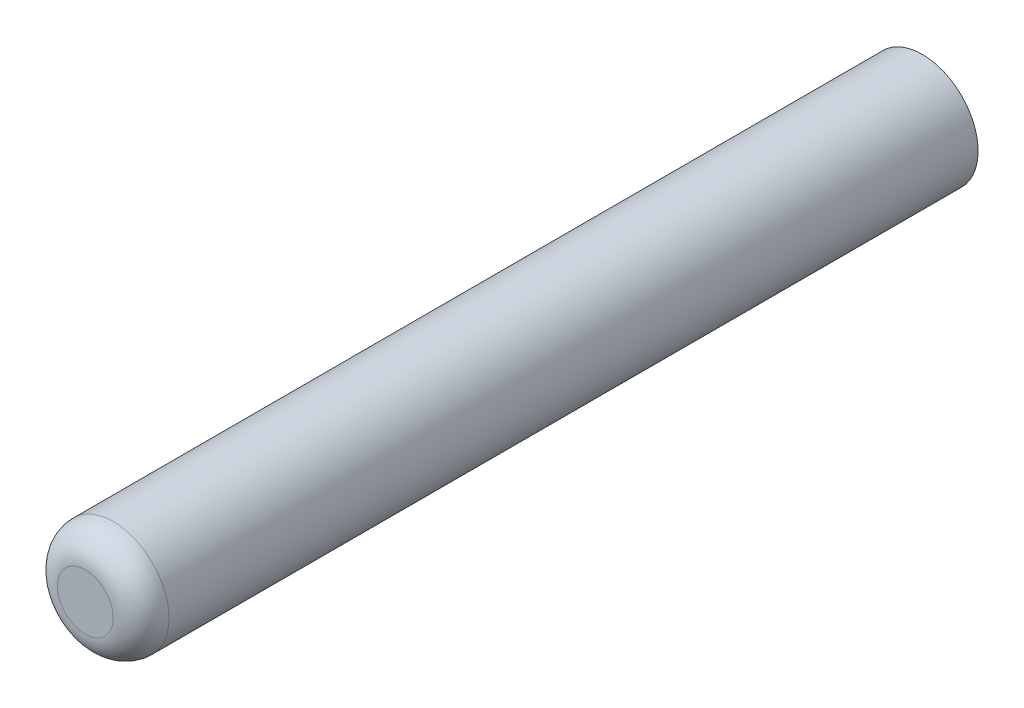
ISO-10303-21;
HEADER;
FILE_DESCRIPTION(('STEP AP214'),'2;1');
FILE_NAME('part.step','',(''),(''),'','','');
FILE_SCHEMA(('AUTOMOTIVE_DESIGN { 1 0 10303 214 1 1 1 1 }'));
ENDSEC;
DATA;
#1=APPLICATION_CONTEXT('core data for automotive mechanical design processes');
#2=APPLICATION_PROTOCOL_DEFINITION('international standard','automotive_design',2000,#1);
#3=PRODUCT_CONTEXT('',#1,'mechanical');
#4=PRODUCT('Part','Part','',(#3));
#5=PRODUCT_RELATED_PRODUCT_CATEGORY('part','',(#4));
#6=PRODUCT_DEFINITION_FORMATION('','',#4);
#7=PRODUCT_DEFINITION_CONTEXT('part definition',#1,'design');
#8=PRODUCT_DEFINITION('design','',#6,#7);
#9=PRODUCT_DEFINITION_SHAPE('','',#8);
#10=(LENGTH_UNIT() NAMED_UNIT(*) SI_UNIT(.MILLI.,.METRE.));
#11=(NAMED_UNIT(*) PLANE_ANGLE_UNIT() SI_UNIT($,.RADIAN.));
#12=(NAMED_UNIT(*) SI_UNIT($,.STERADIAN.) SOLID_ANGLE_UNIT());
#13=UNCERTAINTY_MEASURE_WITH_UNIT(LENGTH_MEASURE(1.E-05),#10,'distance_accuracy_value','');
#14=(GEOMETRIC_REPRESENTATION_CONTEXT(3) GLOBAL_UNCERTAINTY_ASSIGNED_CONTEXT((#13)) GLOBAL_UNIT_ASSIGNED_CONTEXT((#10,
#11,#12)) REPRESENTATION_CONTEXT('',''));
#15=CARTESIAN_POINT('',(0.,0.,0.));
#16=DIRECTION('',(0.,0.,1.));
#17=DIRECTION('',(1.,0.,0.));
#18=AXIS2_PLACEMENT_3D('',#15,#16,#17);
#19=CARTESIAN_POINT('',(0.,0.,7.49999999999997));
#20=DIRECTION('',(0.,0.,-0.999999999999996));
#21=DIRECTION('',(-1.,0.,0.));
#22=AXIS2_PLACEMENT_3D('',#19,#20,#21);
#23=CYLINDRICAL_SURFACE('',#22,0.999999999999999);
#24=CARTESIAN_POINT('',(0.,0.,6.99999999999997));
#25=DIRECTION('',(0.,0.,0.999999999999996));
#26=DIRECTION('',(1.,0.,0.));
#27=AXIS2_PLACEMENT_3D('',#24,#25,#26);
#28=CIRCLE('',#27,0.999999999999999);
#29=CARTESIAN_POINT('',(-1.,0.,6.99999999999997));
#30=VERTEX_POINT('',#29);
#31=EDGE_CURVE('E10',#30,#30,#28,.F.);
#32=CARTESIAN_POINT('',(0.,0.,-7.5));
#33=DIRECTION('',(0.,0.,0.999999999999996));
#34=DIRECTION('',(1.,0.,0.));
#35=AXIS2_PLACEMENT_3D('',#32,#33,#34);
#36=CIRCLE('',#35,0.999999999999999);
#37=CARTESIAN_POINT('',(-1.,0.,-7.5));
#38=VERTEX_POINT('',#37);
#39=EDGE_CURVE('E41',#38,#38,#36,.T.);
#40=CARTESIAN_POINT('',(-1.,0.,6.99999999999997));
#41=CARTESIAN_POINT('',(-1.,0.,6.8489583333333));
#42=CARTESIAN_POINT('',(-1.,0.,6.69791666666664));
#43=CARTESIAN_POINT('',(-1.,0.,6.39583333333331));
#44=CARTESIAN_POINT('',(-1.,0.,6.24479166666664));
#45=CARTESIAN_POINT('',(-1.,0.,5.94270833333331));
#46=CARTESIAN_POINT('',(-1.,0.,5.79166666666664));
#47=CARTESIAN_POINT('',(-1.,0.,5.48958333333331));
#48=CARTESIAN_POINT('',(-1.,0.,5.33854166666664));
#49=CARTESIAN_POINT('',(-1.,0.,5.03645833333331));
#50=CARTESIAN_POINT('',(-1.,0.,4.88541666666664));
#51=CARTESIAN_POINT('',(-1.,0.,4.58333333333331));
#52=CARTESIAN_POINT('',(-1.,0.,4.43229166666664));
#53=CARTESIAN_POINT('',(-1.,0.,4.13020833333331));
#54=CARTESIAN_POINT('',(-1.,0.,3.97916666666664));
#55=CARTESIAN_POINT('',(-1.,0.,3.67708333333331));
#56=CARTESIAN_POINT('',(-1.,0.,3.52604166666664));
#57=CARTESIAN_POINT('',(-1.,0.,3.22395833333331));
#58=CARTESIAN_POINT('',(-1.,0.,3.07291666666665));
#59=CARTESIAN_POINT('',(-1.,0.,2.77083333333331));
#60=CARTESIAN_POINT('',(-1.,0.,2.61979166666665));
#61=CARTESIAN_POINT('',(-1.,0.,2.31770833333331));
#62=CARTESIAN_POINT('',(-1.,0.,2.16666666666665));
#63=CARTESIAN_POINT('',(-1.,0.,1.86458333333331));
#64=CARTESIAN_POINT('',(-1.,0.,1.71354166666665));
#65=CARTESIAN_POINT('',(-1.,0.,1.41145833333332));
#66=CARTESIAN_POINT('',(-1.,0.,1.26041666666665));
#67=CARTESIAN_POINT('',(-1.,0.,0.958333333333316));
#68=CARTESIAN_POINT('',(-1.,0.,0.80729166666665));
#69=CARTESIAN_POINT('',(-1.,0.,0.505208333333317));
#70=CARTESIAN_POINT('',(-1.,0.,0.354166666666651));
#71=CARTESIAN_POINT('',(-1.,0.,0.0520833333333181));
#72=CARTESIAN_POINT('',(-1.,0.,-0.0989583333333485));
#73=CARTESIAN_POINT('',(-1.,0.,-0.401041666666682));
#74=CARTESIAN_POINT('',(-1.,0.,-0.552083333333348));
#75=CARTESIAN_POINT('',(-1.,0.,-0.854166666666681));
#76=CARTESIAN_POINT('',(-1.,0.,-1.00520833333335));
#77=CARTESIAN_POINT('',(-1.,0.,-1.30729166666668));
#78=CARTESIAN_POINT('',(-1.,0.,-1.45833333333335));
#79=CARTESIAN_POINT('',(-1.,0.,-1.76041666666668));
#80=CARTESIAN_POINT('',(-1.,0.,-1.91145833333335));
#81=CARTESIAN_POINT('',(-1.,0.,-2.21354166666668));
#82=CARTESIAN_POINT('',(-1.,0.,-2.36458333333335));
#83=CARTESIAN_POINT('',(-1.,0.,-2.66666666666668));
#84=CARTESIAN_POINT('',(-1.,0.,-2.81770833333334));
#85=CARTESIAN_POINT('',(-1.,0.,-3.11979166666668));
#86=CARTESIAN_POINT('',(-1.,0.,-3.27083333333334));
#87=CARTESIAN_POINT('',(-1.,0.,-3.57291666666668));
#88=CARTESIAN_POINT('',(-1.,0.,-3.72395833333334));
#89=CARTESIAN_POINT('',(-1.,0.,-4.02604166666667));
#90=CARTESIAN_POINT('',(-1.,0.,-4.17708333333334));
#91=CARTESIAN_POINT('',(-1.,0.,-4.47916666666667));
#92=CARTESIAN_POINT('',(-1.,0.,-4.63020833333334));
#93=CARTESIAN_POINT('',(-1.,0.,-4.93229166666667));
#94=CARTESIAN_POINT('',(-1.,0.,-5.08333333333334));
#95=CARTESIAN_POINT('',(-1.,0.,-5.38541666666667));
#96=CARTESIAN_POINT('',(-1.,0.,-5.53645833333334));
#97=CARTESIAN_POINT('',(-1.,0.,-5.83854166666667));
#98=CARTESIAN_POINT('',(-1.,0.,-5.98958333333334));
#99=CARTESIAN_POINT('',(-1.,0.,-6.29166666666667));
#100=CARTESIAN_POINT('',(-1.,0.,-6.44270833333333));
#101=CARTESIAN_POINT('',(-1.,0.,-6.74479166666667));
#102=CARTESIAN_POINT('',(-1.,0.,-6.89583333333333));
#103=CARTESIAN_POINT('',(-1.,0.,-7.19791666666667));
#104=CARTESIAN_POINT('',(-1.,0.,-7.34895833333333));
#105=CARTESIAN_POINT('',(-1.,0.,-7.5));
#106=B_SPLINE_CURVE_WITH_KNOTS('',3,(#40,#41,#42,#43,#44,#45,#46,#47,#48,#49,#50,#51,#52,#53,
#54,#55,#56,#57,#58,#59,#60,#61,#62,#63,#64,#65,#66,#67,#68,#69,#70,#71,#72,#73,#74,#75,#76,#77,
#78,#79,#80,#81,#82,#83,#84,#85,#86,#87,#88,#89,#90,#91,#92,#93,#94,#95,#96,#97,#98,#99,#100,
#101,#102,#103,#104,#105),.UNSPECIFIED.,.F.,.F.,(4,2,2,2,2,2,2,2,2,2,2,2,2,2,2,2,2,2,2,2,2,2,2,
2,2,2,2,2,2,2,2,2,4),(0.,0.453125,0.906249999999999,1.359375,1.8125,2.265625,2.71875,
3.17187499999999,3.62499999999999,4.07812499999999,4.53124999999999,4.98437499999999,
5.43749999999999,5.89062499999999,6.34374999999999,6.79687499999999,7.24999999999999,
7.70312499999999,8.15624999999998,8.60937499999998,9.06249999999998,9.51562499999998,
9.96874999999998,10.421875,10.875,11.328125,11.78125,12.234375,12.6875,13.140625,13.59375,
14.046875,14.5),.UNSPECIFIED.);
#107=EDGE_CURVE('BSEAM31',#30,#38,#106,.T.);
#108=ORIENTED_EDGE('',*,*,#31,.T.);
#109=ORIENTED_EDGE('',*,*,#39,.T.);
#110=ORIENTED_EDGE('',*,*,#107,.T.);
#111=ORIENTED_EDGE('',*,*,#107,.F.);
#112=EDGE_LOOP('',(#108,#110,#109,#111));
#113=FACE_BOUND('',#112,.T.);
#114=ADVANCED_FACE('F31',(#113),#23,.T.);
#115=CARTESIAN_POINT('',(0.,0.,7.49999999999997));
#116=DIRECTION('',(0.,0.,0.999999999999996));
#117=DIRECTION('',(1.,0.,0.));
#118=AXIS2_PLACEMENT_3D('',#115,#116,#117);
#119=PLANE('',#118);
#120=CARTESIAN_POINT('',(0.,0.,7.49999999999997));
#121=DIRECTION('',(0.,0.,0.999999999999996));
#122=DIRECTION('',(1.,0.,0.));
#123=AXIS2_PLACEMENT_3D('',#120,#121,#122);
#124=CIRCLE('',#123,0.499999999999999);
#125=CARTESIAN_POINT('',(0.500000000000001,0.,7.49999999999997));
#126=VERTEX_POINT('',#125);
#127=EDGE_CURVE('E37',#126,#126,#124,.T.);
#128=ORIENTED_EDGE('',*,*,#127,.T.);
#129=EDGE_LOOP('',(#128));
#130=FACE_BOUND('',#129,.T.);
#131=ADVANCED_FACE('F52',(#130),#119,.T.);
#132=CARTESIAN_POINT('',(0.,0.,-7.5));
#133=DIRECTION('',(0.,0.,0.999999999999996));
#134=DIRECTION('',(1.,0.,0.));
#135=AXIS2_PLACEMENT_3D('',#132,#133,#134);
#136=PLANE('',#135);
#137=ORIENTED_EDGE('',*,*,#39,.F.);
#138=EDGE_LOOP('',(#137));
#139=FACE_BOUND('',#138,.T.);
#140=ADVANCED_FACE('F49',(#139),#136,.F.);
#141=CARTESIAN_POINT('',(0.,0.,6.99999999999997));
#142=DIRECTION('',(0.,0.,0.999999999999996));
#143=DIRECTION('',(1.,0.,0.));
#144=AXIS2_PLACEMENT_3D('',#141,#142,#143);
#145=DEGENERATE_TOROIDAL_SURFACE('',#144,0.499999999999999,0.5,.T.);
#146=ORIENTED_EDGE('',*,*,#31,.F.);
#147=EDGE_LOOP('',(#146));
#148=FACE_BOUND('',#147,.T.);
#149=ORIENTED_EDGE('',*,*,#127,.F.);
#150=EDGE_LOOP('',(#149));
#151=FACE_BOUND('',#150,.T.);
#152=ADVANCED_FACE('F51',(#148,#151),#145,.T.);
#153=CLOSED_SHELL('',(#114,#131,#140,#152));
#154=MANIFOLD_SOLID_BREP('B2',#153);
#155=ADVANCED_BREP_SHAPE_REPRESENTATION('',(#18,#154),#14);
#156=SHAPE_DEFINITION_REPRESENTATION(#9,#155);
ENDSEC;
END-ISO-10303-21;
